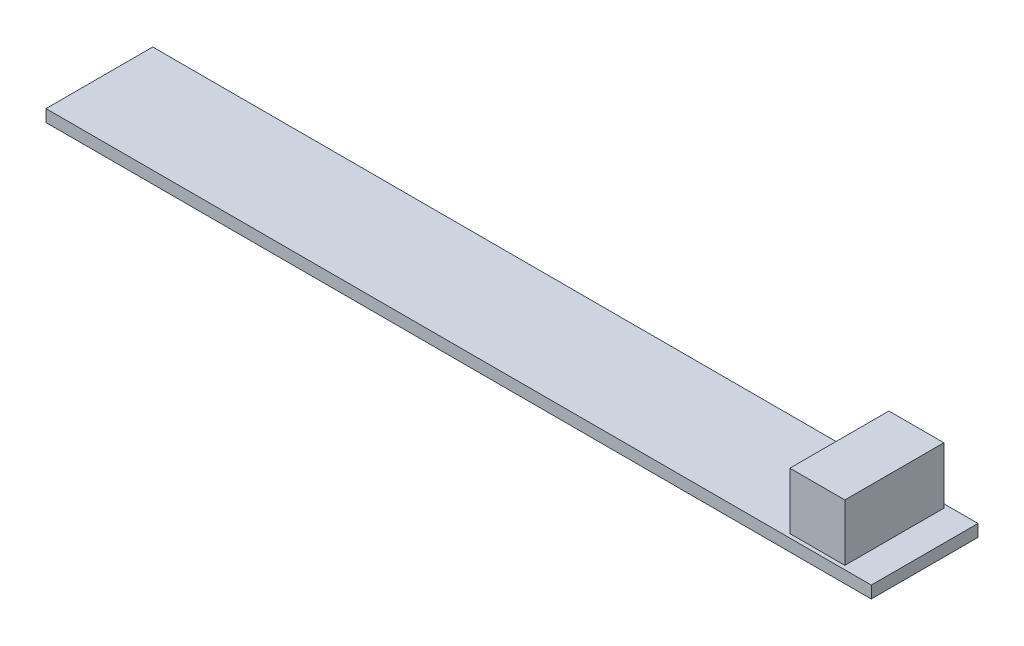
from build123d import *

# Parameters (mm, degrees)
SKETCH1_W           = 76.2
SKETCH1_H           = 9.8552
BOSS_EXTRUDE1_DEPTH = 1.1176
SKETCH2_W           = 5.08
SKETCH2_H           = 9.144
BOSS_EXTRUDE2_DEPTH = 5.2324


with BuildPart() as part:
    # Sketch1 → Boss-Extrude1 (new body)
    with BuildSketch(Plane(origin=(0, 0, 0), x_dir=(1, 0, 0), z_dir=(0, 1, 0))):
        with Locations((38.1, 4.9276)):
            Rectangle(SKETCH1_W, SKETCH1_H)
    extrude(amount=BOSS_EXTRUDE1_DEPTH)

    # Sketch2 → Boss-Extrude2 (add)
    with BuildSketch(Plane(origin=(0, 1.1176, 0), x_dir=(1, 0, 0), z_dir=(0, 1, 0))):
        with Locations((70.866, 4.9276)):
            Rectangle(SKETCH2_W, SKETCH2_H)
    extrude(amount=BOSS_EXTRUDE2_DEPTH)


solid = part.part
